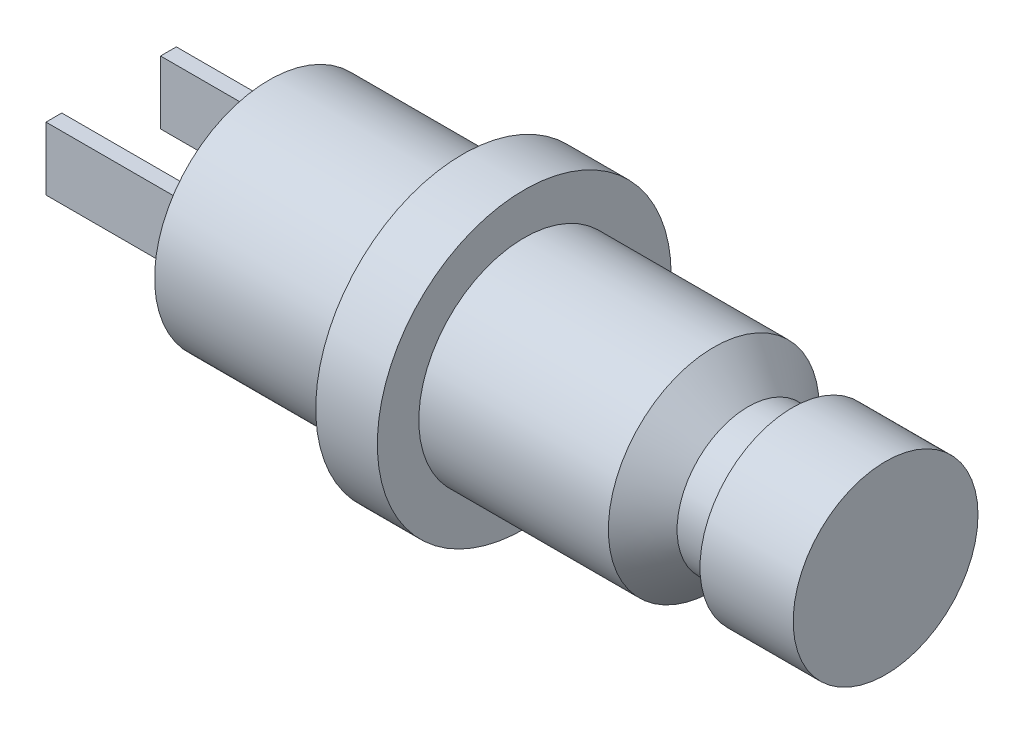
ISO-10303-21;
HEADER;
FILE_DESCRIPTION(('STEP AP214'),'2;1');
FILE_NAME('part.step','',(''),(''),'','','');
FILE_SCHEMA(('AUTOMOTIVE_DESIGN { 1 0 10303 214 1 1 1 1 }'));
ENDSEC;
DATA;
#1=APPLICATION_CONTEXT('core data for automotive mechanical design processes');
#2=APPLICATION_PROTOCOL_DEFINITION('international standard','automotive_design',2000,#1);
#3=PRODUCT_CONTEXT('',#1,'mechanical');
#4=PRODUCT('Part','Part','',(#3));
#5=PRODUCT_RELATED_PRODUCT_CATEGORY('part','',(#4));
#6=PRODUCT_DEFINITION_FORMATION('','',#4);
#7=PRODUCT_DEFINITION_CONTEXT('part definition',#1,'design');
#8=PRODUCT_DEFINITION('design','',#6,#7);
#9=PRODUCT_DEFINITION_SHAPE('','',#8);
#10=(LENGTH_UNIT() NAMED_UNIT(*) SI_UNIT(.MILLI.,.METRE.));
#11=(NAMED_UNIT(*) PLANE_ANGLE_UNIT() SI_UNIT($,.RADIAN.));
#12=(NAMED_UNIT(*) SI_UNIT($,.STERADIAN.) SOLID_ANGLE_UNIT());
#13=UNCERTAINTY_MEASURE_WITH_UNIT(LENGTH_MEASURE(1.E-05),#10,'distance_accuracy_value','');
#14=(GEOMETRIC_REPRESENTATION_CONTEXT(3) GLOBAL_UNCERTAINTY_ASSIGNED_CONTEXT((#13)) GLOBAL_UNIT_ASSIGNED_CONTEXT((#10,
#11,#12)) REPRESENTATION_CONTEXT('',''));
#15=CARTESIAN_POINT('',(0.,0.,0.));
#16=DIRECTION('',(0.,0.,1.));
#17=DIRECTION('',(1.,0.,0.));
#18=AXIS2_PLACEMENT_3D('',#15,#16,#17);
#19=CARTESIAN_POINT('',(0.,3.683,0.));
#20=DIRECTION('',(-1.,0.,0.));
#21=DIRECTION('',(0.,0.,1.));
#22=AXIS2_PLACEMENT_3D('',#19,#20,#21);
#23=PLANE('',#22);
#24=DIRECTION('',(0.,0.,-1.));
#25=VECTOR('',#24,1.);
#26=CARTESIAN_POINT('',(0.,1.016,-2.0955));
#27=LINE('',#26,#25);
#28=CARTESIAN_POINT('',(0.,1.016,-1.5875));
#29=VERTEX_POINT('',#28);
#30=CARTESIAN_POINT('',(0.,1.016,-2.0955));
#31=VERTEX_POINT('',#30);
#32=EDGE_CURVE('E127',#29,#31,#27,.T.);
#33=ORIENTED_EDGE('',*,*,#32,.F.);
#34=DIRECTION('',(0.,1.,0.));
#35=VECTOR('',#34,1.);
#36=CARTESIAN_POINT('',(0.,-1.016,-1.5875));
#37=LINE('',#36,#35);
#38=CARTESIAN_POINT('',(0.,-1.016,-1.5875));
#39=VERTEX_POINT('',#38);
#40=EDGE_CURVE('E124',#39,#29,#37,.T.);
#41=ORIENTED_EDGE('',*,*,#40,.F.);
#42=DIRECTION('',(0.,0.,1.));
#43=VECTOR('',#42,1.);
#44=CARTESIAN_POINT('',(0.,-1.016,-2.0955));
#45=LINE('',#44,#43);
#46=CARTESIAN_POINT('',(0.,-1.016,-2.0955));
#47=VERTEX_POINT('',#46);
#48=EDGE_CURVE('E136',#47,#39,#45,.T.);
#49=ORIENTED_EDGE('',*,*,#48,.F.);
#50=DIRECTION('',(0.,-1.,0.));
#51=VECTOR('',#50,1.);
#52=CARTESIAN_POINT('',(0.,-1.016,-2.0955));
#53=LINE('',#52,#51);
#54=EDGE_CURVE('E144',#31,#47,#53,.T.);
#55=ORIENTED_EDGE('',*,*,#54,.F.);
#56=EDGE_LOOP('',(#33,#41,#49,#55));
#57=FACE_BOUND('',#56,.T.);
#58=CARTESIAN_POINT('',(0.,0.,0.));
#59=DIRECTION('',(1.,0.,0.));
#60=DIRECTION('',(0.,0.,-1.));
#61=AXIS2_PLACEMENT_3D('',#58,#59,#60);
#62=CIRCLE('',#61,3.683);
#63=CARTESIAN_POINT('',(0.,0.,-3.683));
#64=VERTEX_POINT('',#63);
#65=EDGE_CURVE('E11',#64,#64,#62,.T.);
#66=ORIENTED_EDGE('',*,*,#65,.F.);
#67=EDGE_LOOP('',(#66));
#68=FACE_BOUND('',#67,.T.);
#69=DIRECTION('',(0.,0.,1.));
#70=VECTOR('',#69,1.);
#71=CARTESIAN_POINT('',(0.,-1.016,2.0955));
#72=LINE('',#71,#70);
#73=CARTESIAN_POINT('',(0.,-1.016,1.5875));
#74=VERTEX_POINT('',#73);
#75=CARTESIAN_POINT('',(0.,-1.016,2.0955));
#76=VERTEX_POINT('',#75);
#77=EDGE_CURVE('E398',#74,#76,#72,.T.);
#78=ORIENTED_EDGE('',*,*,#77,.F.);
#79=DIRECTION('',(0.,-1.,0.));
#80=VECTOR('',#79,1.);
#81=CARTESIAN_POINT('',(0.,-1.016,1.5875));
#82=LINE('',#81,#80);
#83=CARTESIAN_POINT('',(0.,1.016,1.5875));
#84=VERTEX_POINT('',#83);
#85=EDGE_CURVE('E122',#84,#74,#82,.T.);
#86=ORIENTED_EDGE('',*,*,#85,.F.);
#87=DIRECTION('',(0.,0.,-1.));
#88=VECTOR('',#87,1.);
#89=CARTESIAN_POINT('',(0.,1.016,2.0955));
#90=LINE('',#89,#88);
#91=CARTESIAN_POINT('',(0.,1.016,2.0955));
#92=VERTEX_POINT('',#91);
#93=EDGE_CURVE('E118',#92,#84,#90,.T.);
#94=ORIENTED_EDGE('',*,*,#93,.F.);
#95=DIRECTION('',(0.,1.,0.));
#96=VECTOR('',#95,1.);
#97=CARTESIAN_POINT('',(0.,-1.016,2.0955));
#98=LINE('',#97,#96);
#99=EDGE_CURVE('E395',#76,#92,#98,.T.);
#100=ORIENTED_EDGE('',*,*,#99,.F.);
#101=EDGE_LOOP('',(#78,#86,#94,#100));
#102=FACE_BOUND('',#101,.T.);
#103=ADVANCED_FACE('F34',(#57,#68,#102),#23,.T.);
#104=CARTESIAN_POINT('',(0.,0.,0.));
#105=DIRECTION('',(1.,0.,0.));
#106=DIRECTION('',(0.,0.,-1.));
#107=AXIS2_PLACEMENT_3D('',#104,#105,#106);
#108=CYLINDRICAL_SURFACE('',#107,3.683);
#109=ORIENTED_EDGE('',*,*,#65,.T.);
#110=EDGE_LOOP('',(#109));
#111=FACE_BOUND('',#110,.T.);
#112=CARTESIAN_POINT('',(6.223,0.,0.));
#113=DIRECTION('',(1.,0.,0.));
#114=DIRECTION('',(0.,0.,-1.));
#115=AXIS2_PLACEMENT_3D('',#112,#113,#114);
#116=CIRCLE('',#115,3.683);
#117=CARTESIAN_POINT('',(6.223,0.,-3.683));
#118=VERTEX_POINT('',#117);
#119=EDGE_CURVE('E41',#118,#118,#116,.T.);
#120=ORIENTED_EDGE('',*,*,#119,.F.);
#121=EDGE_LOOP('',(#120));
#122=FACE_BOUND('',#121,.T.);
#123=ADVANCED_FACE('F184',(#111,#122),#108,.T.);
#124=CARTESIAN_POINT('',(6.223,3.683,0.));
#125=DIRECTION('',(-1.,0.,0.));
#126=DIRECTION('',(0.,0.,1.));
#127=AXIS2_PLACEMENT_3D('',#124,#125,#126);
#128=PLANE('',#127);
#129=ORIENTED_EDGE('',*,*,#119,.T.);
#130=EDGE_LOOP('',(#129));
#131=FACE_BOUND('',#130,.T.);
#132=CARTESIAN_POINT('',(6.223,0.,0.));
#133=DIRECTION('',(1.,0.,0.));
#134=DIRECTION('',(0.,0.,-1.));
#135=AXIS2_PLACEMENT_3D('',#132,#133,#134);
#136=CIRCLE('',#135,4.7244);
#137=CARTESIAN_POINT('',(6.223,0.,-4.7244));
#138=VERTEX_POINT('',#137);
#139=EDGE_CURVE('E176',#138,#138,#136,.T.);
#140=ORIENTED_EDGE('',*,*,#139,.F.);
#141=EDGE_LOOP('',(#140));
#142=FACE_BOUND('',#141,.T.);
#143=ADVANCED_FACE('F181',(#131,#142),#128,.T.);
#144=CARTESIAN_POINT('',(0.,0.,0.));
#145=DIRECTION('',(1.,0.,0.));
#146=DIRECTION('',(0.,0.,-1.));
#147=AXIS2_PLACEMENT_3D('',#144,#145,#146);
#148=CYLINDRICAL_SURFACE('',#147,4.7244);
#149=ORIENTED_EDGE('',*,*,#139,.T.);
#150=EDGE_LOOP('',(#149));
#151=FACE_BOUND('',#150,.T.);
#152=CARTESIAN_POINT('',(8.2042,0.,0.));
#153=DIRECTION('',(1.,0.,0.));
#154=DIRECTION('',(0.,0.,-1.));
#155=AXIS2_PLACEMENT_3D('',#152,#153,#154);
#156=CIRCLE('',#155,4.7244);
#157=CARTESIAN_POINT('',(8.2042,0.,-4.7244));
#158=VERTEX_POINT('',#157);
#159=EDGE_CURVE('E173',#158,#158,#156,.T.);
#160=ORIENTED_EDGE('',*,*,#159,.F.);
#161=EDGE_LOOP('',(#160));
#162=FACE_BOUND('',#161,.T.);
#163=ADVANCED_FACE('F191',(#151,#162),#148,.T.);
#164=CARTESIAN_POINT('',(8.2042,4.7244,0.));
#165=DIRECTION('',(1.,0.,0.));
#166=DIRECTION('',(0.,0.,-1.));
#167=AXIS2_PLACEMENT_3D('',#164,#165,#166);
#168=PLANE('',#167);
#169=ORIENTED_EDGE('',*,*,#159,.T.);
#170=EDGE_LOOP('',(#169));
#171=FACE_BOUND('',#170,.T.);
#172=CARTESIAN_POINT('',(8.2042,0.,0.));
#173=DIRECTION('',(1.,0.,0.));
#174=DIRECTION('',(0.,0.,-1.));
#175=AXIS2_PLACEMENT_3D('',#172,#173,#174);
#176=CIRCLE('',#175,3.3909);
#177=CARTESIAN_POINT('',(8.2042,0.,-3.3909));
#178=VERTEX_POINT('',#177);
#179=EDGE_CURVE('E170',#178,#178,#176,.T.);
#180=ORIENTED_EDGE('',*,*,#179,.F.);
#181=EDGE_LOOP('',(#180));
#182=FACE_BOUND('',#181,.T.);
#183=ADVANCED_FACE('F197',(#171,#182),#168,.T.);
#184=CARTESIAN_POINT('',(0.,0.,0.));
#185=DIRECTION('',(1.,0.,0.));
#186=DIRECTION('',(0.,0.,-1.));
#187=AXIS2_PLACEMENT_3D('',#184,#185,#186);
#188=CYLINDRICAL_SURFACE('',#187,3.3909);
#189=ORIENTED_EDGE('',*,*,#179,.T.);
#190=EDGE_LOOP('',(#189));
#191=FACE_BOUND('',#190,.T.);
#192=CARTESIAN_POINT('',(14.3002,0.,0.));
#193=DIRECTION('',(1.,0.,0.));
#194=DIRECTION('',(0.,0.,-1.));
#195=AXIS2_PLACEMENT_3D('',#192,#193,#194);
#196=CIRCLE('',#195,3.3909);
#197=CARTESIAN_POINT('',(14.3002,0.,-3.3909));
#198=VERTEX_POINT('',#197);
#199=EDGE_CURVE('E167',#198,#198,#196,.T.);
#200=ORIENTED_EDGE('',*,*,#199,.F.);
#201=EDGE_LOOP('',(#200));
#202=FACE_BOUND('',#201,.T.);
#203=ADVANCED_FACE('F201',(#191,#202),#188,.T.);
#204=CARTESIAN_POINT('',(15.4051,0.,0.));
#205=DIRECTION('',(-1.,0.,0.));
#206=DIRECTION('',(0.,0.,1.));
#207=AXIS2_PLACEMENT_3D('',#204,#205,#206);
#208=CONICAL_SURFACE('',#207,2.286,0.78539816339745);
#209=ORIENTED_EDGE('',*,*,#199,.T.);
#210=EDGE_LOOP('',(#209));
#211=FACE_BOUND('',#210,.T.);
#212=CARTESIAN_POINT('',(15.4051,0.,0.));
#213=DIRECTION('',(1.,0.,0.));
#214=DIRECTION('',(0.,0.,-1.));
#215=AXIS2_PLACEMENT_3D('',#212,#213,#214);
#216=CIRCLE('',#215,2.286);
#217=CARTESIAN_POINT('',(15.4051,0.,-2.286));
#218=VERTEX_POINT('',#217);
#219=EDGE_CURVE('E164',#218,#218,#216,.T.);
#220=ORIENTED_EDGE('',*,*,#219,.F.);
#221=EDGE_LOOP('',(#220));
#222=FACE_BOUND('',#221,.T.);
#223=ADVANCED_FACE('F205',(#211,#222),#208,.T.);
#224=CARTESIAN_POINT('',(0.,0.,0.));
#225=DIRECTION('',(1.,0.,0.));
#226=DIRECTION('',(0.,0.,-1.));
#227=AXIS2_PLACEMENT_3D('',#224,#225,#226);
#228=CYLINDRICAL_SURFACE('',#227,2.286);
#229=ORIENTED_EDGE('',*,*,#219,.T.);
#230=EDGE_LOOP('',(#229));
#231=FACE_BOUND('',#230,.T.);
#232=CARTESIAN_POINT('',(16.8275,0.,0.));
#233=DIRECTION('',(1.,0.,0.));
#234=DIRECTION('',(0.,0.,-1.));
#235=AXIS2_PLACEMENT_3D('',#232,#233,#234);
#236=CIRCLE('',#235,2.286);
#237=CARTESIAN_POINT('',(16.8275,0.,-2.286));
#238=VERTEX_POINT('',#237);
#239=EDGE_CURVE('E161',#238,#238,#236,.T.);
#240=ORIENTED_EDGE('',*,*,#239,.F.);
#241=EDGE_LOOP('',(#240));
#242=FACE_BOUND('',#241,.T.);
#243=ADVANCED_FACE('F209',(#231,#242),#228,.T.);
#244=CARTESIAN_POINT('',(16.8275,2.9718,0.));
#245=DIRECTION('',(-1.,0.,0.));
#246=DIRECTION('',(0.,0.,1.));
#247=AXIS2_PLACEMENT_3D('',#244,#245,#246);
#248=PLANE('',#247);
#249=ORIENTED_EDGE('',*,*,#239,.T.);
#250=EDGE_LOOP('',(#249));
#251=FACE_BOUND('',#250,.T.);
#252=CARTESIAN_POINT('',(16.8275,0.,0.));
#253=DIRECTION('',(1.,0.,0.));
#254=DIRECTION('',(0.,0.,-1.));
#255=AXIS2_PLACEMENT_3D('',#252,#253,#254);
#256=CIRCLE('',#255,2.9718);
#257=CARTESIAN_POINT('',(16.8275,0.,-2.9718));
#258=VERTEX_POINT('',#257);
#259=EDGE_CURVE('E158',#258,#258,#256,.T.);
#260=ORIENTED_EDGE('',*,*,#259,.F.);
#261=EDGE_LOOP('',(#260));
#262=FACE_BOUND('',#261,.T.);
#263=ADVANCED_FACE('F213',(#251,#262),#248,.T.);
#264=CARTESIAN_POINT('',(0.,0.,0.));
#265=DIRECTION('',(1.,0.,0.));
#266=DIRECTION('',(0.,0.,-1.));
#267=AXIS2_PLACEMENT_3D('',#264,#265,#266);
#268=CYLINDRICAL_SURFACE('',#267,2.9718);
#269=ORIENTED_EDGE('',*,*,#259,.T.);
#270=EDGE_LOOP('',(#269));
#271=FACE_BOUND('',#270,.T.);
#272=CARTESIAN_POINT('',(19.8247,0.,0.));
#273=DIRECTION('',(1.,0.,0.));
#274=DIRECTION('',(0.,0.,-1.));
#275=AXIS2_PLACEMENT_3D('',#272,#273,#274);
#276=CIRCLE('',#275,2.9718);
#277=CARTESIAN_POINT('',(19.8247,0.,-2.9718));
#278=VERTEX_POINT('',#277);
#279=EDGE_CURVE('E155',#278,#278,#276,.T.);
#280=ORIENTED_EDGE('',*,*,#279,.F.);
#281=EDGE_LOOP('',(#280));
#282=FACE_BOUND('',#281,.T.);
#283=ADVANCED_FACE('F217',(#271,#282),#268,.T.);
#284=CARTESIAN_POINT('',(19.8247,2.9718,0.));
#285=DIRECTION('',(1.,0.,0.));
#286=DIRECTION('',(0.,0.,-1.));
#287=AXIS2_PLACEMENT_3D('',#284,#285,#286);
#288=PLANE('',#287);
#289=ORIENTED_EDGE('',*,*,#279,.T.);
#290=EDGE_LOOP('',(#289));
#291=FACE_BOUND('',#290,.T.);
#292=ADVANCED_FACE('F221',(#291),#288,.T.);
#293=CARTESIAN_POINT('',(-5.08,-1.016,-1.5875));
#294=DIRECTION('',(0.,0.,-1.));
#295=DIRECTION('',(-1.,0.,0.));
#296=AXIS2_PLACEMENT_3D('',#293,#294,#295);
#297=PLANE('',#296);
#298=ORIENTED_EDGE('',*,*,#40,.T.);
#299=DIRECTION('',(1.,0.,0.));
#300=VECTOR('',#299,1.);
#301=CARTESIAN_POINT('',(-5.08,1.016,-1.5875));
#302=LINE('',#301,#300);
#303=CARTESIAN_POINT('',(-5.08,1.016,-1.5875));
#304=VERTEX_POINT('',#303);
#305=EDGE_CURVE('E153',#304,#29,#302,.T.);
#306=ORIENTED_EDGE('',*,*,#305,.F.);
#307=DIRECTION('',(0.,1.,0.));
#308=VECTOR('',#307,1.);
#309=CARTESIAN_POINT('',(-5.08,-1.016,-1.5875));
#310=LINE('',#309,#308);
#311=CARTESIAN_POINT('',(-5.08,-1.016,-1.5875));
#312=VERTEX_POINT('',#311);
#313=EDGE_CURVE('E132',#312,#304,#310,.T.);
#314=ORIENTED_EDGE('',*,*,#313,.F.);
#315=DIRECTION('',(1.,0.,0.));
#316=VECTOR('',#315,1.);
#317=CARTESIAN_POINT('',(-5.08,-1.016,-1.5875));
#318=LINE('',#317,#316);
#319=EDGE_CURVE('E141',#312,#39,#318,.T.);
#320=ORIENTED_EDGE('',*,*,#319,.T.);
#321=EDGE_LOOP('',(#298,#306,#314,#320));
#322=FACE_BOUND('',#321,.T.);
#323=ADVANCED_FACE('F225',(#322),#297,.F.);
#324=CARTESIAN_POINT('',(-5.08,1.016,-2.0955));
#325=DIRECTION('',(0.,-1.,0.));
#326=DIRECTION('',(0.,0.,-1.));
#327=AXIS2_PLACEMENT_3D('',#324,#325,#326);
#328=PLANE('',#327);
#329=ORIENTED_EDGE('',*,*,#32,.T.);
#330=DIRECTION('',(1.,0.,0.));
#331=VECTOR('',#330,1.);
#332=CARTESIAN_POINT('',(-5.08,1.016,-2.0955));
#333=LINE('',#332,#331);
#334=CARTESIAN_POINT('',(-5.08,1.016,-2.0955));
#335=VERTEX_POINT('',#334);
#336=EDGE_CURVE('E150',#335,#31,#333,.T.);
#337=ORIENTED_EDGE('',*,*,#336,.F.);
#338=DIRECTION('',(0.,0.,-1.));
#339=VECTOR('',#338,1.);
#340=CARTESIAN_POINT('',(-5.08,1.016,-2.0955));
#341=LINE('',#340,#339);
#342=EDGE_CURVE('E135',#304,#335,#341,.T.);
#343=ORIENTED_EDGE('',*,*,#342,.F.);
#344=ORIENTED_EDGE('',*,*,#305,.T.);
#345=EDGE_LOOP('',(#329,#337,#343,#344));
#346=FACE_BOUND('',#345,.T.);
#347=ADVANCED_FACE('F229',(#346),#328,.F.);
#348=CARTESIAN_POINT('',(-5.08,-1.016,-2.0955));
#349=DIRECTION('',(0.,0.,1.));
#350=DIRECTION('',(1.,0.,0.));
#351=AXIS2_PLACEMENT_3D('',#348,#349,#350);
#352=PLANE('',#351);
#353=ORIENTED_EDGE('',*,*,#54,.T.);
#354=DIRECTION('',(1.,0.,0.));
#355=VECTOR('',#354,1.);
#356=CARTESIAN_POINT('',(-5.08,-1.016,-2.0955));
#357=LINE('',#356,#355);
#358=CARTESIAN_POINT('',(-5.08,-1.016,-2.0955));
#359=VERTEX_POINT('',#358);
#360=EDGE_CURVE('E56',#359,#47,#357,.T.);
#361=ORIENTED_EDGE('',*,*,#360,.F.);
#362=DIRECTION('',(0.,-1.,0.));
#363=VECTOR('',#362,1.);
#364=CARTESIAN_POINT('',(-5.08,-1.016,-2.0955));
#365=LINE('',#364,#363);
#366=EDGE_CURVE('E138',#335,#359,#365,.T.);
#367=ORIENTED_EDGE('',*,*,#366,.F.);
#368=ORIENTED_EDGE('',*,*,#336,.T.);
#369=EDGE_LOOP('',(#353,#361,#367,#368));
#370=FACE_BOUND('',#369,.T.);
#371=ADVANCED_FACE('F233',(#370),#352,.F.);
#372=CARTESIAN_POINT('',(-5.08,-1.016,-2.0955));
#373=DIRECTION('',(0.,1.,0.));
#374=DIRECTION('',(0.,0.,1.));
#375=AXIS2_PLACEMENT_3D('',#372,#373,#374);
#376=PLANE('',#375);
#377=ORIENTED_EDGE('',*,*,#48,.T.);
#378=ORIENTED_EDGE('',*,*,#319,.F.);
#379=DIRECTION('',(0.,0.,1.));
#380=VECTOR('',#379,1.);
#381=CARTESIAN_POINT('',(-5.08,-1.016,-2.0955));
#382=LINE('',#381,#380);
#383=EDGE_CURVE('E140',#359,#312,#382,.T.);
#384=ORIENTED_EDGE('',*,*,#383,.F.);
#385=ORIENTED_EDGE('',*,*,#360,.T.);
#386=EDGE_LOOP('',(#377,#378,#384,#385));
#387=FACE_BOUND('',#386,.T.);
#388=ADVANCED_FACE('F237',(#387),#376,.F.);
#389=CARTESIAN_POINT('',(-5.08,0.,0.));
#390=DIRECTION('',(1.,0.,0.));
#391=DIRECTION('',(0.,0.,-1.));
#392=AXIS2_PLACEMENT_3D('',#389,#390,#391);
#393=PLANE('',#392);
#394=ORIENTED_EDGE('',*,*,#313,.T.);
#395=ORIENTED_EDGE('',*,*,#342,.T.);
#396=ORIENTED_EDGE('',*,*,#366,.T.);
#397=ORIENTED_EDGE('',*,*,#383,.T.);
#398=EDGE_LOOP('',(#394,#395,#396,#397));
#399=FACE_BOUND('',#398,.T.);
#400=ADVANCED_FACE('F241',(#399),#393,.F.);
#401=CARTESIAN_POINT('',(-5.08,-1.016,1.5875));
#402=DIRECTION('',(0.,0.,1.));
#403=DIRECTION('',(1.,0.,0.));
#404=AXIS2_PLACEMENT_3D('',#401,#402,#403);
#405=PLANE('',#404);
#406=ORIENTED_EDGE('',*,*,#85,.T.);
#407=DIRECTION('',(1.,0.,0.));
#408=VECTOR('',#407,1.);
#409=CARTESIAN_POINT('',(-5.08,-1.016,1.5875));
#410=LINE('',#409,#408);
#411=CARTESIAN_POINT('',(-5.08,-1.016,1.5875));
#412=VERTEX_POINT('',#411);
#413=EDGE_CURVE('E103',#412,#74,#410,.T.);
#414=ORIENTED_EDGE('',*,*,#413,.F.);
#415=DIRECTION('',(0.,-1.,0.));
#416=VECTOR('',#415,1.);
#417=CARTESIAN_POINT('',(-5.08,-1.016,1.5875));
#418=LINE('',#417,#416);
#419=CARTESIAN_POINT('',(-5.08,1.016,1.5875));
#420=VERTEX_POINT('',#419);
#421=EDGE_CURVE('E110',#420,#412,#418,.T.);
#422=ORIENTED_EDGE('',*,*,#421,.F.);
#423=DIRECTION('',(1.,0.,0.));
#424=VECTOR('',#423,1.);
#425=CARTESIAN_POINT('',(-5.08,1.016,1.5875));
#426=LINE('',#425,#424);
#427=EDGE_CURVE('E392',#420,#84,#426,.T.);
#428=ORIENTED_EDGE('',*,*,#427,.T.);
#429=EDGE_LOOP('',(#406,#414,#422,#428));
#430=FACE_BOUND('',#429,.T.);
#431=ADVANCED_FACE('F120',(#430),#405,.F.);
#432=CARTESIAN_POINT('',(-5.08,-1.016,2.0955));
#433=DIRECTION('',(0.,1.,0.));
#434=DIRECTION('',(0.,0.,1.));
#435=AXIS2_PLACEMENT_3D('',#432,#433,#434);
#436=PLANE('',#435);
#437=ORIENTED_EDGE('',*,*,#77,.T.);
#438=DIRECTION('',(1.,0.,0.));
#439=VECTOR('',#438,1.);
#440=CARTESIAN_POINT('',(-5.08,-1.016,2.0955));
#441=LINE('',#440,#439);
#442=CARTESIAN_POINT('',(-5.08,-1.016,2.0955));
#443=VERTEX_POINT('',#442);
#444=EDGE_CURVE('E106',#443,#76,#441,.T.);
#445=ORIENTED_EDGE('',*,*,#444,.F.);
#446=DIRECTION('',(0.,0.,1.));
#447=VECTOR('',#446,1.);
#448=CARTESIAN_POINT('',(-5.08,-1.016,2.0955));
#449=LINE('',#448,#447);
#450=EDGE_CURVE('E99',#412,#443,#449,.T.);
#451=ORIENTED_EDGE('',*,*,#450,.F.);
#452=ORIENTED_EDGE('',*,*,#413,.T.);
#453=EDGE_LOOP('',(#437,#445,#451,#452));
#454=FACE_BOUND('',#453,.T.);
#455=ADVANCED_FACE('F101',(#454),#436,.F.);
#456=CARTESIAN_POINT('',(-5.08,-1.016,2.0955));
#457=DIRECTION('',(0.,0.,-1.));
#458=DIRECTION('',(0.,1.,0.));
#459=AXIS2_PLACEMENT_3D('',#456,#457,#458);
#460=PLANE('',#459);
#461=ORIENTED_EDGE('',*,*,#99,.T.);
#462=DIRECTION('',(1.,0.,0.));
#463=VECTOR('',#462,1.);
#464=CARTESIAN_POINT('',(-5.08,1.016,2.0955));
#465=LINE('',#464,#463);
#466=CARTESIAN_POINT('',(-5.08,1.016,2.0955));
#467=VERTEX_POINT('',#466);
#468=EDGE_CURVE('E48',#467,#92,#465,.T.);
#469=ORIENTED_EDGE('',*,*,#468,.F.);
#470=DIRECTION('',(0.,1.,0.));
#471=VECTOR('',#470,1.);
#472=CARTESIAN_POINT('',(-5.08,-1.016,2.0955));
#473=LINE('',#472,#471);
#474=EDGE_CURVE('E109',#443,#467,#473,.T.);
#475=ORIENTED_EDGE('',*,*,#474,.F.);
#476=ORIENTED_EDGE('',*,*,#444,.T.);
#477=EDGE_LOOP('',(#461,#469,#475,#476));
#478=FACE_BOUND('',#477,.T.);
#479=ADVANCED_FACE('F249',(#478),#460,.F.);
#480=CARTESIAN_POINT('',(-5.08,1.016,2.0955));
#481=DIRECTION('',(0.,-1.,0.));
#482=DIRECTION('',(0.,0.,-1.));
#483=AXIS2_PLACEMENT_3D('',#480,#481,#482);
#484=PLANE('',#483);
#485=ORIENTED_EDGE('',*,*,#93,.T.);
#486=ORIENTED_EDGE('',*,*,#427,.F.);
#487=DIRECTION('',(0.,0.,-1.));
#488=VECTOR('',#487,1.);
#489=CARTESIAN_POINT('',(-5.08,1.016,2.0955));
#490=LINE('',#489,#488);
#491=EDGE_CURVE('E114',#467,#420,#490,.T.);
#492=ORIENTED_EDGE('',*,*,#491,.F.);
#493=ORIENTED_EDGE('',*,*,#468,.T.);
#494=EDGE_LOOP('',(#485,#486,#492,#493));
#495=FACE_BOUND('',#494,.T.);
#496=ADVANCED_FACE('F252',(#495),#484,.F.);
#497=CARTESIAN_POINT('',(-5.08,0.,0.));
#498=DIRECTION('',(-1.,0.,0.));
#499=DIRECTION('',(0.,0.,1.));
#500=AXIS2_PLACEMENT_3D('',#497,#498,#499);
#501=PLANE('',#500);
#502=ORIENTED_EDGE('',*,*,#421,.T.);
#503=ORIENTED_EDGE('',*,*,#450,.T.);
#504=ORIENTED_EDGE('',*,*,#474,.T.);
#505=ORIENTED_EDGE('',*,*,#491,.T.);
#506=EDGE_LOOP('',(#502,#503,#504,#505));
#507=FACE_BOUND('',#506,.T.);
#508=ADVANCED_FACE('F113',(#507),#501,.T.);
#509=CLOSED_SHELL('',(#103,#123,#143,#163,#183,#203,#223,#243,#263,#283,#292,#323,#347,#371,
#388,#400,#431,#455,#479,#496,#508));
#510=MANIFOLD_SOLID_BREP('B2',#509);
#511=ADVANCED_BREP_SHAPE_REPRESENTATION('',(#18,#510),#14);
#512=SHAPE_DEFINITION_REPRESENTATION(#9,#511);
ENDSEC;
END-ISO-10303-21;
